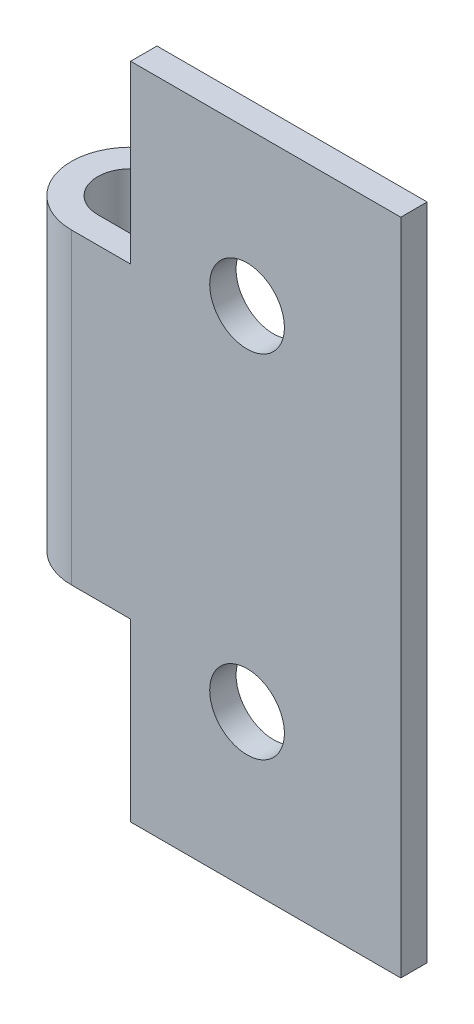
from build123d import *

# Parameters (mm, degrees)
Y_KSEKLIK_EKSTR_ZYON1_DEPTH = 30
KES_EKSTR_ZYON2_START       = -8
KES_EKSTR_ZYON2_DEPTH       = 8
IZIM4_R                     = 1.7
KES_EKSTR_ZYON3_DEPTH       = 1.2


with BuildPart() as part:
    # izim1 → Y_kseklik-Ekstr_zyon1 (new body)
    with BuildSketch(Plane(origin=(0, 0, 0), x_dir=(1, 0, 0), z_dir=(0, 1, 0))):
        with BuildLine():
            Line((0, 0.6), (15, 0.6))
            Line((15, 0.6), (15, -0.6))
            Line((15, -0.6), (0, -0.6))
            ThreePointArc((0, -0.6), (-1.319038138, 4.455873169), (2.301841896, 0.688786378))
            Line((2.301841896, 0.688786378), (1.278801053, 1.315992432))
            ThreePointArc((1.278801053, 1.315992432), (-0.732798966, 3.408818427), (0, 0.6))
        make_face()
    extrude(amount=-Y_KSEKLIK_EKSTR_ZYON1_DEPTH)

    # izim3 → Kes-Ekstr_zyon2 (cut)
    with BuildSketch(Plane.XZ.offset(30).offset(KES_EKSTR_ZYON2_START)):
        with BuildLine():
            Line((1.278801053, -1.315992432), (2.301841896, -0.688786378))
            ThreePointArc((2.301841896, -0.688786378), (-1.319038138, -4.455873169), (0, 0.6))
            Line((0, 0.6), (2.7, 0.6))
            Line((2.7, 0.6), (2.7, -0.6))
            Line((2.7, -0.6), (0, -0.6))
            ThreePointArc((0, -0.6), (-0.732798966, -3.408818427), (1.278801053, -1.315992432))
        make_face()
    kes_ekstr_zyon2 = extrude(amount=KES_EKSTR_ZYON2_DEPTH, mode=Mode.SUBTRACT)

    # izim4 → Kes-Ekstr_zyon3 (cut)
    with BuildSketch(Plane(origin=(0, 0, -0.6), x_dir=(-1, 0, 0), z_dir=(0, 0, -1))):
        with Locations((-8, -23)):
            Circle(IZIM4_R)
        with Locations((-8, -7)):
            Circle(IZIM4_R)
    extrude(amount=-KES_EKSTR_ZYON3_DEPTH, mode=Mode.SUBTRACT)

    # Aynalama1: Kes-Ekstr_zyon2 across plane
    add(kes_ekstr_zyon2.mirror(Plane(origin=(0, -15, 0), x_dir=(0, 0, 1), z_dir=(0, -1, 0))), mode=Mode.SUBTRACT)


solid = part.part
